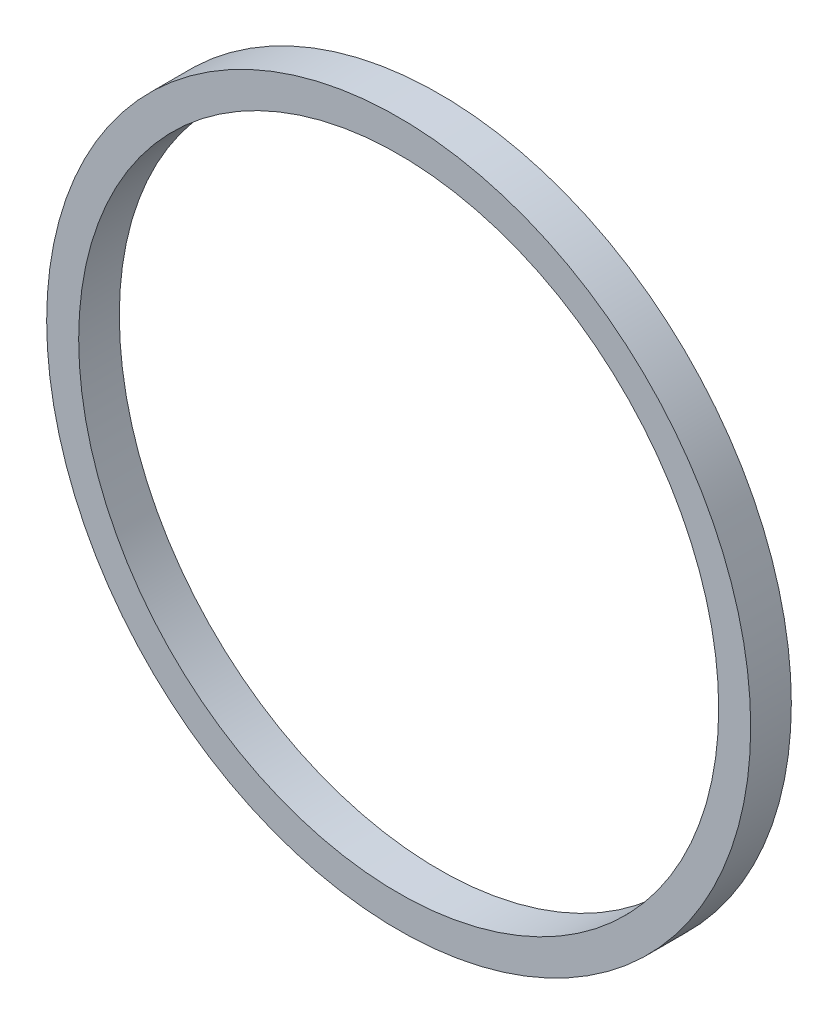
ISO-10303-21;
HEADER;
FILE_DESCRIPTION(('STEP AP214'),'2;1');
FILE_NAME('part.step','',(''),(''),'','','');
FILE_SCHEMA(('AUTOMOTIVE_DESIGN { 1 0 10303 214 1 1 1 1 }'));
ENDSEC;
DATA;
#1=APPLICATION_CONTEXT('core data for automotive mechanical design processes');
#2=APPLICATION_PROTOCOL_DEFINITION('international standard','automotive_design',2000,#1);
#3=PRODUCT_CONTEXT('',#1,'mechanical');
#4=PRODUCT('Part','Part','',(#3));
#5=PRODUCT_RELATED_PRODUCT_CATEGORY('part','',(#4));
#6=PRODUCT_DEFINITION_FORMATION('','',#4);
#7=PRODUCT_DEFINITION_CONTEXT('part definition',#1,'design');
#8=PRODUCT_DEFINITION('design','',#6,#7);
#9=PRODUCT_DEFINITION_SHAPE('','',#8);
#10=(LENGTH_UNIT() NAMED_UNIT(*) SI_UNIT(.MILLI.,.METRE.));
#11=(NAMED_UNIT(*) PLANE_ANGLE_UNIT() SI_UNIT($,.RADIAN.));
#12=(NAMED_UNIT(*) SI_UNIT($,.STERADIAN.) SOLID_ANGLE_UNIT());
#13=UNCERTAINTY_MEASURE_WITH_UNIT(LENGTH_MEASURE(1.E-05),#10,'distance_accuracy_value','');
#14=(GEOMETRIC_REPRESENTATION_CONTEXT(3) GLOBAL_UNCERTAINTY_ASSIGNED_CONTEXT((#13)) GLOBAL_UNIT_ASSIGNED_CONTEXT((#10,
#11,#12)) REPRESENTATION_CONTEXT('',''));
#15=CARTESIAN_POINT('',(0.,0.,0.));
#16=DIRECTION('',(0.,0.,1.));
#17=DIRECTION('',(1.,0.,0.));
#18=AXIS2_PLACEMENT_3D('',#15,#16,#17);
#19=CARTESIAN_POINT('',(0.,0.,-3.175));
#20=DIRECTION('',(0.,0.,1.));
#21=DIRECTION('',(1.,0.,0.));
#22=AXIS2_PLACEMENT_3D('',#19,#20,#21);
#23=CYLINDRICAL_SURFACE('',#22,55.);
#24=CARTESIAN_POINT('',(0.,0.,-3.175));
#25=DIRECTION('',(0.,0.,1.));
#26=DIRECTION('',(1.,0.,0.));
#27=AXIS2_PLACEMENT_3D('',#24,#25,#26);
#28=CIRCLE('',#27,55.);
#29=CARTESIAN_POINT('',(55.,0.,-3.175));
#30=VERTEX_POINT('',#29);
#31=EDGE_CURVE('E10',#30,#30,#28,.T.);
#32=ORIENTED_EDGE('',*,*,#31,.T.);
#33=EDGE_LOOP('',(#32));
#34=FACE_BOUND('',#33,.T.);
#35=CARTESIAN_POINT('',(0.,0.,3.175));
#36=DIRECTION('',(0.,0.,1.));
#37=DIRECTION('',(1.,0.,0.));
#38=AXIS2_PLACEMENT_3D('',#35,#36,#37);
#39=CIRCLE('',#38,55.);
#40=CARTESIAN_POINT('',(55.,0.,3.175));
#41=VERTEX_POINT('',#40);
#42=EDGE_CURVE('E38',#41,#41,#39,.T.);
#43=ORIENTED_EDGE('',*,*,#42,.F.);
#44=EDGE_LOOP('',(#43));
#45=FACE_BOUND('',#44,.T.);
#46=ADVANCED_FACE('F28',(#34,#45),#23,.T.);
#47=CARTESIAN_POINT('',(0.,0.,-3.175));
#48=DIRECTION('',(0.,0.,1.));
#49=DIRECTION('',(1.,0.,0.));
#50=AXIS2_PLACEMENT_3D('',#47,#48,#49);
#51=PLANE('',#50);
#52=CARTESIAN_POINT('',(0.,0.,-3.175));
#53=DIRECTION('',(0.,0.,1.));
#54=DIRECTION('',(1.,0.,0.));
#55=AXIS2_PLACEMENT_3D('',#52,#53,#54);
#56=CIRCLE('',#55,50.);
#57=CARTESIAN_POINT('',(50.,0.,-3.175));
#58=VERTEX_POINT('',#57);
#59=EDGE_CURVE('E34',#58,#58,#56,.T.);
#60=ORIENTED_EDGE('',*,*,#59,.T.);
#61=EDGE_LOOP('',(#60));
#62=FACE_BOUND('',#61,.T.);
#63=ORIENTED_EDGE('',*,*,#31,.F.);
#64=EDGE_LOOP('',(#63));
#65=FACE_BOUND('',#64,.T.);
#66=ADVANCED_FACE('F57',(#62,#65),#51,.F.);
#67=CARTESIAN_POINT('',(0.,0.,-3.175));
#68=DIRECTION('',(0.,0.,1.));
#69=DIRECTION('',(1.,0.,0.));
#70=AXIS2_PLACEMENT_3D('',#67,#68,#69);
#71=CYLINDRICAL_SURFACE('',#70,50.);
#72=ORIENTED_EDGE('',*,*,#59,.F.);
#73=EDGE_LOOP('',(#72));
#74=FACE_BOUND('',#73,.T.);
#75=CARTESIAN_POINT('',(0.,0.,3.175));
#76=DIRECTION('',(0.,0.,1.));
#77=DIRECTION('',(1.,0.,0.));
#78=AXIS2_PLACEMENT_3D('',#75,#76,#77);
#79=CIRCLE('',#78,50.);
#80=CARTESIAN_POINT('',(50.,0.,3.175));
#81=VERTEX_POINT('',#80);
#82=EDGE_CURVE('E42',#81,#81,#79,.T.);
#83=ORIENTED_EDGE('',*,*,#82,.T.);
#84=EDGE_LOOP('',(#83));
#85=FACE_BOUND('',#84,.T.);
#86=ADVANCED_FACE('F48',(#74,#85),#71,.F.);
#87=CARTESIAN_POINT('',(0.,0.,3.175));
#88=DIRECTION('',(0.,0.,1.));
#89=DIRECTION('',(1.,0.,0.));
#90=AXIS2_PLACEMENT_3D('',#87,#88,#89);
#91=PLANE('',#90);
#92=ORIENTED_EDGE('',*,*,#42,.T.);
#93=EDGE_LOOP('',(#92));
#94=FACE_BOUND('',#93,.T.);
#95=ORIENTED_EDGE('',*,*,#82,.F.);
#96=EDGE_LOOP('',(#95));
#97=FACE_BOUND('',#96,.T.);
#98=ADVANCED_FACE('F50',(#94,#97),#91,.T.);
#99=CLOSED_SHELL('',(#46,#66,#86,#98));
#100=MANIFOLD_SOLID_BREP('B2',#99);
#101=ADVANCED_BREP_SHAPE_REPRESENTATION('',(#18,#100),#14);
#102=SHAPE_DEFINITION_REPRESENTATION(#9,#101);
ENDSEC;
END-ISO-10303-21;
